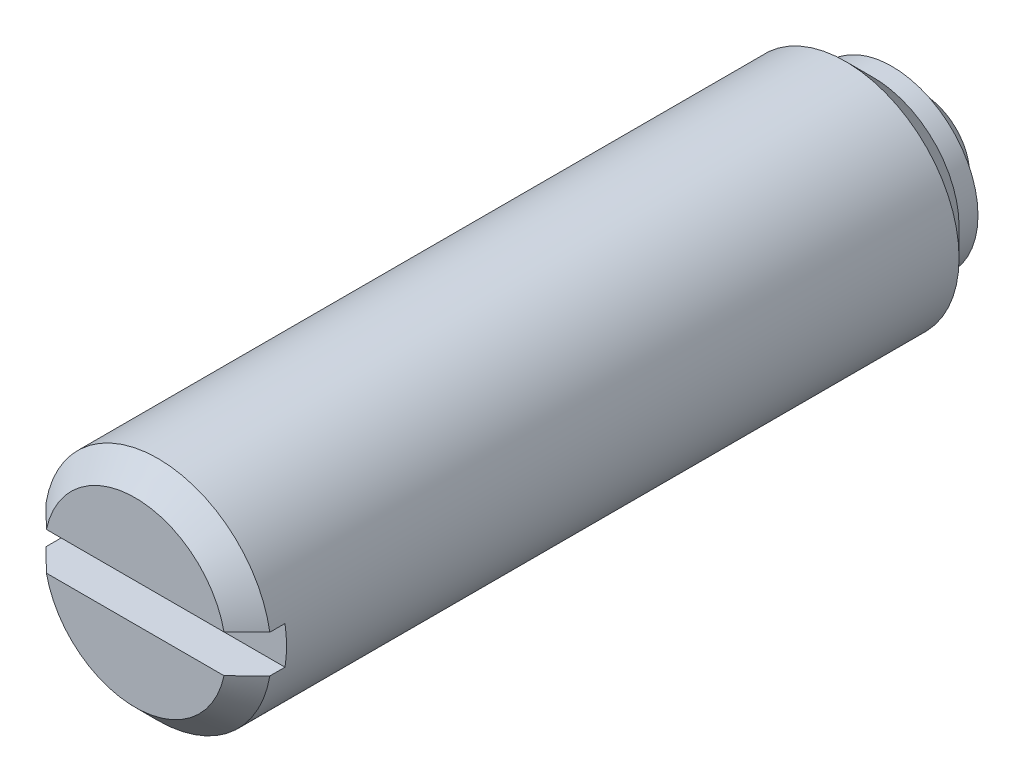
ISO-10303-21;
HEADER;
FILE_DESCRIPTION(('STEP AP214'),'2;1');
FILE_NAME('part.step','',(''),(''),'','','');
FILE_SCHEMA(('AUTOMOTIVE_DESIGN { 1 0 10303 214 1 1 1 1 }'));
ENDSEC;
DATA;
#1=APPLICATION_CONTEXT('core data for automotive mechanical design processes');
#2=APPLICATION_PROTOCOL_DEFINITION('international standard','automotive_design',2000,#1);
#3=PRODUCT_CONTEXT('',#1,'mechanical');
#4=PRODUCT('Part','Part','',(#3));
#5=PRODUCT_RELATED_PRODUCT_CATEGORY('part','',(#4));
#6=PRODUCT_DEFINITION_FORMATION('','',#4);
#7=PRODUCT_DEFINITION_CONTEXT('part definition',#1,'design');
#8=PRODUCT_DEFINITION('design','',#6,#7);
#9=PRODUCT_DEFINITION_SHAPE('','',#8);
#10=(LENGTH_UNIT() NAMED_UNIT(*) SI_UNIT(.MILLI.,.METRE.));
#11=(NAMED_UNIT(*) PLANE_ANGLE_UNIT() SI_UNIT($,.RADIAN.));
#12=(NAMED_UNIT(*) SI_UNIT($,.STERADIAN.) SOLID_ANGLE_UNIT());
#13=UNCERTAINTY_MEASURE_WITH_UNIT(LENGTH_MEASURE(1.E-05),#10,'distance_accuracy_value','');
#14=(GEOMETRIC_REPRESENTATION_CONTEXT(3) GLOBAL_UNCERTAINTY_ASSIGNED_CONTEXT((#13)) GLOBAL_UNIT_ASSIGNED_CONTEXT((#10,
#11,#12)) REPRESENTATION_CONTEXT('',''));
#15=CARTESIAN_POINT('',(0.,0.,0.));
#16=DIRECTION('',(0.,0.,1.));
#17=DIRECTION('',(1.,0.,0.));
#18=AXIS2_PLACEMENT_3D('',#15,#16,#17);
#19=CARTESIAN_POINT('',(0.,0.,2.5));
#20=DIRECTION('',(0.,0.,-1.));
#21=DIRECTION('',(-1.,0.,0.));
#22=AXIS2_PLACEMENT_3D('',#19,#20,#21);
#23=PLANE('',#22);
#24=CARTESIAN_POINT('',(0.,0.,2.5));
#25=DIRECTION('',(0.,0.,-1.));
#26=DIRECTION('',(-1.,0.,0.));
#27=AXIS2_PLACEMENT_3D('',#24,#25,#26);
#28=CIRCLE('',#27,3.70809924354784);
#29=CARTESIAN_POINT('',(-3.70809924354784,0.,2.5));
#30=VERTEX_POINT('',#29);
#31=EDGE_CURVE('E152',#30,#30,#28,.T.);
#32=ORIENTED_EDGE('',*,*,#31,.F.);
#33=EDGE_LOOP('',(#32));
#34=FACE_BOUND('',#33,.T.);
#35=CARTESIAN_POINT('',(0.,0.,2.5));
#36=DIRECTION('',(0.,0.,1.));
#37=DIRECTION('',(1.,0.,0.));
#38=AXIS2_PLACEMENT_3D('',#35,#36,#37);
#39=CIRCLE('',#38,4.55);
#40=CARTESIAN_POINT('',(4.55,0.,2.5));
#41=VERTEX_POINT('',#40);
#42=EDGE_CURVE('E159',#41,#41,#39,.T.);
#43=ORIENTED_EDGE('',*,*,#42,.F.);
#44=EDGE_LOOP('',(#43));
#45=FACE_BOUND('',#44,.T.);
#46=ADVANCED_FACE('F15',(#34,#45),#23,.T.);
#47=CARTESIAN_POINT('',(0.,0.,4.));
#48=DIRECTION('',(0.,0.,-1.));
#49=DIRECTION('',(1.,0.,0.));
#50=AXIS2_PLACEMENT_3D('',#47,#48,#49);
#51=SPHERICAL_SURFACE('',#50,4.);
#52=ORIENTED_EDGE('',*,*,#31,.T.);
#53=EDGE_LOOP('',(#52));
#54=FACE_BOUND('',#53,.T.);
#55=ADVANCED_FACE('F179',(#54),#51,.T.);
#56=CARTESIAN_POINT('',(0.,0.,48.0109494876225));
#57=DIRECTION('',(0.,0.,1.));
#58=DIRECTION('',(1.,0.,0.));
#59=AXIS2_PLACEMENT_3D('',#56,#57,#58);
#60=CYLINDRICAL_SURFACE('',#59,4.55);
#61=ORIENTED_EDGE('',*,*,#42,.T.);
#62=EDGE_LOOP('',(#61));
#63=FACE_BOUND('',#62,.T.);
#64=CARTESIAN_POINT('',(0.,0.,3.5));
#65=DIRECTION('',(0.,0.,1.));
#66=DIRECTION('',(1.,0.,0.));
#67=AXIS2_PLACEMENT_3D('',#64,#65,#66);
#68=CIRCLE('',#67,4.55);
#69=CARTESIAN_POINT('',(4.55,0.,3.5));
#70=VERTEX_POINT('',#69);
#71=EDGE_CURVE('E162',#70,#70,#68,.T.);
#72=ORIENTED_EDGE('',*,*,#71,.F.);
#73=EDGE_LOOP('',(#72));
#74=FACE_BOUND('',#73,.T.);
#75=ADVANCED_FACE('F171',(#63,#74),#60,.T.);
#76=CARTESIAN_POINT('',(0.,0.,4.95));
#77=DIRECTION('',(0.,0.,1.));
#78=DIRECTION('',(1.,0.,0.));
#79=AXIS2_PLACEMENT_3D('',#76,#77,#78);
#80=CONICAL_SURFACE('',#79,6.,0.78539816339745);
#81=ORIENTED_EDGE('',*,*,#71,.T.);
#82=EDGE_LOOP('',(#81));
#83=FACE_BOUND('',#82,.T.);
#84=CARTESIAN_POINT('',(0.,0.,4.95));
#85=DIRECTION('',(0.,0.,1.));
#86=DIRECTION('',(1.,0.,0.));
#87=AXIS2_PLACEMENT_3D('',#84,#85,#86);
#88=CIRCLE('',#87,6.);
#89=CARTESIAN_POINT('',(6.,0.,4.95));
#90=VERTEX_POINT('',#89);
#91=EDGE_CURVE('E165',#90,#90,#88,.T.);
#92=ORIENTED_EDGE('',*,*,#91,.F.);
#93=EDGE_LOOP('',(#92));
#94=FACE_BOUND('',#93,.T.);
#95=ADVANCED_FACE('F169',(#83,#94),#80,.T.);
#96=CARTESIAN_POINT('',(0.,6.,42.5));
#97=DIRECTION('',(0.,0.,1.));
#98=DIRECTION('',(1.,0.,0.));
#99=AXIS2_PLACEMENT_3D('',#96,#97,#98);
#100=PLANE('',#99);
#101=DIRECTION('',(1.,0.,0.));
#102=VECTOR('',#101,1.);
#103=CARTESIAN_POINT('',(-5.91607978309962,-1.,42.5));
#104=LINE('',#103,#102);
#105=CARTESIAN_POINT('',(-4.69467783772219,-1.,42.5));
#106=VERTEX_POINT('',#105);
#107=CARTESIAN_POINT('',(4.69467783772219,-1.,42.5));
#108=VERTEX_POINT('',#107);
#109=EDGE_CURVE('E149',#106,#108,#104,.T.);
#110=ORIENTED_EDGE('',*,*,#109,.F.);
#111=CARTESIAN_POINT('',(0.,0.,42.5));
#112=DIRECTION('',(0.,0.,1.));
#113=DIRECTION('',(1.,0.,0.));
#114=AXIS2_PLACEMENT_3D('',#111,#112,#113);
#115=CIRCLE('',#114,4.8);
#116=EDGE_CURVE('E143',#106,#108,#115,.T.);
#117=ORIENTED_EDGE('',*,*,#116,.T.);
#118=EDGE_LOOP('',(#110,#117));
#119=FACE_BOUND('',#118,.T.);
#120=ADVANCED_FACE('F125',(#119),#100,.T.);
#121=CARTESIAN_POINT('',(-5.91607978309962,-1.,40.5));
#122=DIRECTION('',(0.,-1.,0.));
#123=DIRECTION('',(1.,0.,0.));
#124=AXIS2_PLACEMENT_3D('',#121,#122,#123);
#125=PLANE('',#124);
#126=DIRECTION('',(0.,0.,1.));
#127=VECTOR('',#126,1.);
#128=CARTESIAN_POINT('',(-5.91607978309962,-1.,40.5));
#129=LINE('',#128,#127);
#130=CARTESIAN_POINT('',(-5.91607978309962,-1.,40.5));
#131=VERTEX_POINT('',#130);
#132=CARTESIAN_POINT('',(-5.91607978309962,-1.,41.3));
#133=VERTEX_POINT('',#132);
#134=EDGE_CURVE('E82',#131,#133,#129,.T.);
#135=ORIENTED_EDGE('',*,*,#134,.T.);
#136=CARTESIAN_POINT('',(-5.91607978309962,-1.,41.3));
#137=CARTESIAN_POINT('',(-5.81447550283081,-1.,41.4001822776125));
#138=CARTESIAN_POINT('',(-5.71283625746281,-1.,41.5003291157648));
#139=CARTESIAN_POINT('',(-5.50947387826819,-1.,41.7005373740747));
#140=CARTESIAN_POINT('',(-5.40775074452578,-1.,41.8005987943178));
#141=CARTESIAN_POINT('',(-5.20420639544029,-1.,42.00062190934));
#142=CARTESIAN_POINT('',(-5.10238518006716,-1.,42.1005836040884));
#143=CARTESIAN_POINT('',(-4.89862484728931,-1.,42.3003869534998));
#144=CARTESIAN_POINT('',(-4.79668572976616,-1.,42.4002286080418));
#145=CARTESIAN_POINT('',(-4.69467783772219,-1.,42.5));
#146=B_SPLINE_CURVE_WITH_KNOTS('',3,(#136,#137,#138,#139,#140,#141,#142,#143,#144,#145),
.UNSPECIFIED.,.F.,.F.,(4,2,2,2,4),(0.,0.428064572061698,0.856128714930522,1.28419298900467,
1.71225769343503),.UNSPECIFIED.);
#147=EDGE_CURVE('E111',#133,#106,#146,.T.);
#148=ORIENTED_EDGE('',*,*,#147,.T.);
#149=ORIENTED_EDGE('',*,*,#109,.T.);
#150=CARTESIAN_POINT('',(4.69467783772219,-1.,42.5));
#151=CARTESIAN_POINT('',(4.79668572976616,-1.,42.4002286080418));
#152=CARTESIAN_POINT('',(4.89862484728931,-1.,42.3003869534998));
#153=CARTESIAN_POINT('',(5.10238518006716,-1.,42.1005836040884));
#154=CARTESIAN_POINT('',(5.20420639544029,-1.,42.00062190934));
#155=CARTESIAN_POINT('',(5.40775074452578,-1.,41.8005987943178));
#156=CARTESIAN_POINT('',(5.50947387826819,-1.,41.7005373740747));
#157=CARTESIAN_POINT('',(5.71283625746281,-1.,41.5003291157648));
#158=CARTESIAN_POINT('',(5.81447550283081,-1.,41.4001822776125));
#159=CARTESIAN_POINT('',(5.91607978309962,-1.,41.3));
#160=B_SPLINE_CURVE_WITH_KNOTS('',3,(#150,#151,#152,#153,#154,#155,#156,#157,#158,#159),
.UNSPECIFIED.,.F.,.F.,(4,2,2,2,4),(0.,0.428064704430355,0.856128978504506,1.28419312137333,
1.71225769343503),.UNSPECIFIED.);
#161=CARTESIAN_POINT('',(5.91607978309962,-1.,41.3));
#162=VERTEX_POINT('',#161);
#163=EDGE_CURVE('E104',#108,#162,#160,.T.);
#164=ORIENTED_EDGE('',*,*,#163,.T.);
#165=DIRECTION('',(0.,0.,1.));
#166=VECTOR('',#165,1.);
#167=CARTESIAN_POINT('',(5.91607978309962,-1.,40.5));
#168=LINE('',#167,#166);
#169=CARTESIAN_POINT('',(5.91607978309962,-1.,40.5));
#170=VERTEX_POINT('',#169);
#171=EDGE_CURVE('E84',#170,#162,#168,.T.);
#172=ORIENTED_EDGE('',*,*,#171,.F.);
#173=DIRECTION('',(1.,0.,0.));
#174=VECTOR('',#173,1.);
#175=CARTESIAN_POINT('',(-5.91607978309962,-1.,40.5));
#176=LINE('',#175,#174);
#177=EDGE_CURVE('E69',#131,#170,#176,.T.);
#178=ORIENTED_EDGE('',*,*,#177,.F.);
#179=EDGE_LOOP('',(#135,#148,#149,#164,#172,#178));
#180=FACE_BOUND('',#179,.T.);
#181=ADVANCED_FACE('F81',(#180),#125,.F.);
#182=DIRECTION('',(1.,0.,0.));
#183=VECTOR('',#182,1.);
#184=CARTESIAN_POINT('',(-5.91607978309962,1.,42.5));
#185=LINE('',#184,#183);
#186=CARTESIAN_POINT('',(-4.69467783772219,1.,42.5));
#187=VERTEX_POINT('',#186);
#188=CARTESIAN_POINT('',(4.69467783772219,1.,42.5));
#189=VERTEX_POINT('',#188);
#190=EDGE_CURVE('E76',#187,#189,#185,.T.);
#191=ORIENTED_EDGE('',*,*,#190,.T.);
#192=CARTESIAN_POINT('',(0.,0.,42.5));
#193=DIRECTION('',(0.,0.,1.));
#194=DIRECTION('',(1.,0.,0.));
#195=AXIS2_PLACEMENT_3D('',#192,#193,#194);
#196=CIRCLE('',#195,4.8);
#197=EDGE_CURVE('E9',#189,#187,#196,.T.);
#198=ORIENTED_EDGE('',*,*,#197,.T.);
#199=EDGE_LOOP('',(#191,#198));
#200=FACE_BOUND('',#199,.T.);
#201=ADVANCED_FACE('F124',(#200),#100,.T.);
#202=CARTESIAN_POINT('',(-5.91607978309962,1.,40.5));
#203=DIRECTION('',(0.,-1.,0.));
#204=DIRECTION('',(1.,0.,0.));
#205=AXIS2_PLACEMENT_3D('',#202,#203,#204);
#206=PLANE('',#205);
#207=DIRECTION('',(0.,0.,1.));
#208=VECTOR('',#207,1.);
#209=CARTESIAN_POINT('',(5.91607978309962,1.,40.5));
#210=LINE('',#209,#208);
#211=CARTESIAN_POINT('',(5.91607978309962,1.,40.5));
#212=VERTEX_POINT('',#211);
#213=CARTESIAN_POINT('',(5.91607978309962,1.,41.3));
#214=VERTEX_POINT('',#213);
#215=EDGE_CURVE('E93',#212,#214,#210,.T.);
#216=ORIENTED_EDGE('',*,*,#215,.T.);
#217=CARTESIAN_POINT('',(5.91607978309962,1.,41.3));
#218=CARTESIAN_POINT('',(5.81447550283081,1.,41.4001822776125));
#219=CARTESIAN_POINT('',(5.71283625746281,0.999999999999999,41.5003291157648));
#220=CARTESIAN_POINT('',(5.50947387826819,0.999999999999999,41.7005373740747));
#221=CARTESIAN_POINT('',(5.40775074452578,0.999999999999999,41.8005987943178));
#222=CARTESIAN_POINT('',(5.20420639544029,0.999999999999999,42.00062190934));
#223=CARTESIAN_POINT('',(5.10238518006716,0.999999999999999,42.1005836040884));
#224=CARTESIAN_POINT('',(4.89862484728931,0.999999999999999,42.3003869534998));
#225=CARTESIAN_POINT('',(4.79668572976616,1.,42.4002286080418));
#226=CARTESIAN_POINT('',(4.69467783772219,1.,42.5));
#227=B_SPLINE_CURVE_WITH_KNOTS('',3,(#217,#218,#219,#220,#221,#222,#223,#224,#225,#226),
.UNSPECIFIED.,.F.,.F.,(4,2,2,2,4),(0.,0.428064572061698,0.856128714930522,1.28419298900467,
1.71225769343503),.UNSPECIFIED.);
#228=EDGE_CURVE('E24',#214,#189,#227,.T.);
#229=ORIENTED_EDGE('',*,*,#228,.T.);
#230=ORIENTED_EDGE('',*,*,#190,.F.);
#231=CARTESIAN_POINT('',(-4.69467783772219,1.,42.5));
#232=CARTESIAN_POINT('',(-4.79668572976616,1.,42.4002286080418));
#233=CARTESIAN_POINT('',(-4.89862484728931,1.,42.3003869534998));
#234=CARTESIAN_POINT('',(-5.10238518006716,1.,42.1005836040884));
#235=CARTESIAN_POINT('',(-5.20420639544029,1.,42.00062190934));
#236=CARTESIAN_POINT('',(-5.40775074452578,1.,41.8005987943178));
#237=CARTESIAN_POINT('',(-5.50947387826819,1.,41.7005373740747));
#238=CARTESIAN_POINT('',(-5.71283625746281,1.,41.5003291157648));
#239=CARTESIAN_POINT('',(-5.81447550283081,1.,41.4001822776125));
#240=CARTESIAN_POINT('',(-5.91607978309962,1.,41.3));
#241=B_SPLINE_CURVE_WITH_KNOTS('',3,(#231,#232,#233,#234,#235,#236,#237,#238,#239,#240),
.UNSPECIFIED.,.F.,.F.,(4,2,2,2,4),(0.,0.428064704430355,0.856128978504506,1.28419312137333,
1.71225769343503),.UNSPECIFIED.);
#242=CARTESIAN_POINT('',(-5.91607978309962,1.,41.3));
#243=VERTEX_POINT('',#242);
#244=EDGE_CURVE('E134',#187,#243,#241,.T.);
#245=ORIENTED_EDGE('',*,*,#244,.T.);
#246=DIRECTION('',(0.,0.,1.));
#247=VECTOR('',#246,1.);
#248=CARTESIAN_POINT('',(-5.91607978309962,1.,40.5));
#249=LINE('',#248,#247);
#250=CARTESIAN_POINT('',(-5.91607978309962,1.,40.5));
#251=VERTEX_POINT('',#250);
#252=EDGE_CURVE('E98',#251,#243,#249,.T.);
#253=ORIENTED_EDGE('',*,*,#252,.F.);
#254=DIRECTION('',(1.,0.,0.));
#255=VECTOR('',#254,1.);
#256=CARTESIAN_POINT('',(-5.91607978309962,1.,40.5));
#257=LINE('',#256,#255);
#258=EDGE_CURVE('E72',#251,#212,#257,.T.);
#259=ORIENTED_EDGE('',*,*,#258,.T.);
#260=EDGE_LOOP('',(#216,#229,#230,#245,#253,#259));
#261=FACE_BOUND('',#260,.T.);
#262=ADVANCED_FACE('F127',(#261),#206,.T.);
#263=CARTESIAN_POINT('',(0.,0.,40.5));
#264=DIRECTION('',(0.,0.,1.));
#265=DIRECTION('',(1.,0.,0.));
#266=AXIS2_PLACEMENT_3D('',#263,#264,#265);
#267=PLANE('',#266);
#268=CARTESIAN_POINT('',(0.,0.,40.5));
#269=DIRECTION('',(0.,0.,1.));
#270=DIRECTION('',(1.,0.,0.));
#271=AXIS2_PLACEMENT_3D('',#268,#269,#270);
#272=CIRCLE('',#271,6.);
#273=EDGE_CURVE('E66',#251,#131,#272,.T.);
#274=ORIENTED_EDGE('',*,*,#273,.T.);
#275=ORIENTED_EDGE('',*,*,#177,.T.);
#276=EDGE_CURVE('E78',#170,#212,#272,.T.);
#277=ORIENTED_EDGE('',*,*,#276,.T.);
#278=ORIENTED_EDGE('',*,*,#258,.F.);
#279=EDGE_LOOP('',(#274,#275,#277,#278));
#280=FACE_BOUND('',#279,.T.);
#281=ADVANCED_FACE('F68',(#280),#267,.T.);
#282=CARTESIAN_POINT('',(0.,0.,12.5));
#283=DIRECTION('',(0.,0.,-1.));
#284=DIRECTION('',(-1.,0.,0.));
#285=AXIS2_PLACEMENT_3D('',#282,#283,#284);
#286=CYLINDRICAL_SURFACE('',#285,6.);
#287=ORIENTED_EDGE('',*,*,#171,.T.);
#288=CARTESIAN_POINT('',(0.,0.,41.3));
#289=DIRECTION('',(0.,0.,1.));
#290=DIRECTION('',(1.,0.,0.));
#291=AXIS2_PLACEMENT_3D('',#288,#289,#290);
#292=CIRCLE('',#291,6.);
#293=EDGE_CURVE('E91',#162,#133,#292,.F.);
#294=ORIENTED_EDGE('',*,*,#293,.T.);
#295=ORIENTED_EDGE('',*,*,#134,.F.);
#296=ORIENTED_EDGE('',*,*,#273,.F.);
#297=ORIENTED_EDGE('',*,*,#252,.T.);
#298=CARTESIAN_POINT('',(0.,0.,41.3));
#299=DIRECTION('',(0.,0.,1.));
#300=DIRECTION('',(1.,0.,0.));
#301=AXIS2_PLACEMENT_3D('',#298,#299,#300);
#302=CIRCLE('',#301,6.);
#303=EDGE_CURVE('E100',#243,#214,#302,.F.);
#304=ORIENTED_EDGE('',*,*,#303,.T.);
#305=ORIENTED_EDGE('',*,*,#215,.F.);
#306=ORIENTED_EDGE('',*,*,#276,.F.);
#307=EDGE_LOOP('',(#287,#294,#295,#296,#297,#304,#305,#306));
#308=FACE_BOUND('',#307,.T.);
#309=ORIENTED_EDGE('',*,*,#91,.T.);
#310=EDGE_LOOP('',(#309));
#311=FACE_BOUND('',#310,.T.);
#312=ADVANCED_FACE('F88',(#308,#311),#286,.T.);
#313=CARTESIAN_POINT('',(0.,0.,41.3));
#314=DIRECTION('',(0.,0.,-1.));
#315=DIRECTION('',(-1.,0.,0.));
#316=AXIS2_PLACEMENT_3D('',#313,#314,#315);
#317=CONICAL_SURFACE('',#316,6.,0.785398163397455);
#318=ORIENTED_EDGE('',*,*,#163,.F.);
#319=ORIENTED_EDGE('',*,*,#116,.F.);
#320=ORIENTED_EDGE('',*,*,#147,.F.);
#321=ORIENTED_EDGE('',*,*,#293,.F.);
#322=EDGE_LOOP('',(#318,#319,#320,#321));
#323=FACE_BOUND('',#322,.T.);
#324=ADVANCED_FACE('F117',(#323),#317,.T.);
#325=CARTESIAN_POINT('',(0.,0.,41.3));
#326=DIRECTION('',(0.,0.,-1.));
#327=DIRECTION('',(-1.,0.,0.));
#328=AXIS2_PLACEMENT_3D('',#325,#326,#327);
#329=CONICAL_SURFACE('',#328,6.,0.785398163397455);
#330=ORIENTED_EDGE('',*,*,#244,.F.);
#331=ORIENTED_EDGE('',*,*,#197,.F.);
#332=ORIENTED_EDGE('',*,*,#228,.F.);
#333=ORIENTED_EDGE('',*,*,#303,.F.);
#334=EDGE_LOOP('',(#330,#331,#332,#333));
#335=FACE_BOUND('',#334,.T.);
#336=ADVANCED_FACE('F17',(#335),#329,.T.);
#337=CLOSED_SHELL('',(#46,#55,#75,#95,#120,#181,#201,#262,#281,#312,#324,#336));
#338=MANIFOLD_SOLID_BREP('B1',#337);
#339=ADVANCED_BREP_SHAPE_REPRESENTATION('',(#18,#338),#14);
#340=SHAPE_DEFINITION_REPRESENTATION(#9,#339);
ENDSEC;
END-ISO-10303-21;
